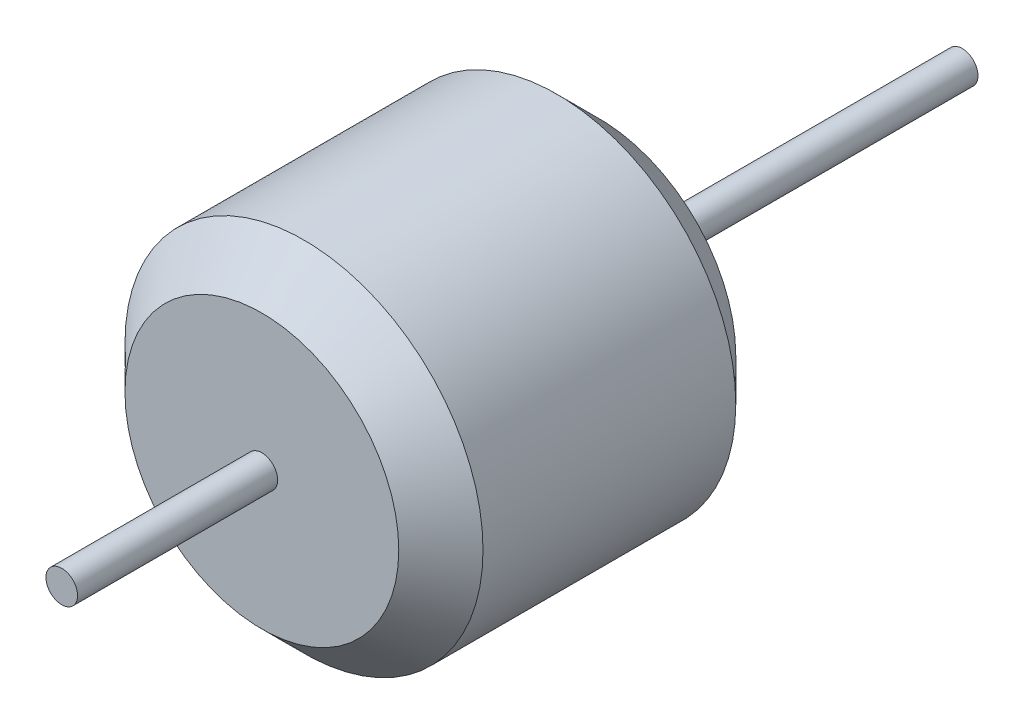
ISO-10303-21;
HEADER;
FILE_DESCRIPTION(('STEP AP214'),'2;1');
FILE_NAME('part.step','',(''),(''),'','','');
FILE_SCHEMA(('AUTOMOTIVE_DESIGN { 1 0 10303 214 1 1 1 1 }'));
ENDSEC;
DATA;
#1=APPLICATION_CONTEXT('core data for automotive mechanical design processes');
#2=APPLICATION_PROTOCOL_DEFINITION('international standard','automotive_design',2000,#1);
#3=PRODUCT_CONTEXT('',#1,'mechanical');
#4=PRODUCT('Part','Part','',(#3));
#5=PRODUCT_RELATED_PRODUCT_CATEGORY('part','',(#4));
#6=PRODUCT_DEFINITION_FORMATION('','',#4);
#7=PRODUCT_DEFINITION_CONTEXT('part definition',#1,'design');
#8=PRODUCT_DEFINITION('design','',#6,#7);
#9=PRODUCT_DEFINITION_SHAPE('','',#8);
#10=(LENGTH_UNIT() NAMED_UNIT(*) SI_UNIT(.MILLI.,.METRE.));
#11=(NAMED_UNIT(*) PLANE_ANGLE_UNIT() SI_UNIT($,.RADIAN.));
#12=(NAMED_UNIT(*) SI_UNIT($,.STERADIAN.) SOLID_ANGLE_UNIT());
#13=UNCERTAINTY_MEASURE_WITH_UNIT(LENGTH_MEASURE(1.E-05),#10,'distance_accuracy_value','');
#14=(GEOMETRIC_REPRESENTATION_CONTEXT(3) GLOBAL_UNCERTAINTY_ASSIGNED_CONTEXT((#13)) GLOBAL_UNIT_ASSIGNED_CONTEXT((#10,
#11,#12)) REPRESENTATION_CONTEXT('',''));
#15=CARTESIAN_POINT('',(0.,0.,0.));
#16=DIRECTION('',(0.,0.,1.));
#17=DIRECTION('',(1.,0.,0.));
#18=AXIS2_PLACEMENT_3D('',#15,#16,#17);
#19=CARTESIAN_POINT('',(0.,0.,32.));
#20=DIRECTION('',(0.,0.,-1.));
#21=DIRECTION('',(-1.,0.,0.));
#22=AXIS2_PLACEMENT_3D('',#19,#20,#21);
#23=CYLINDRICAL_SURFACE('',#22,17.);
#24=CARTESIAN_POINT('',(0.,0.,3.99999999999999));
#25=DIRECTION('',(0.,0.,1.));
#26=DIRECTION('',(1.,0.,0.));
#27=AXIS2_PLACEMENT_3D('',#24,#25,#26);
#28=CIRCLE('',#27,17.);
#29=CARTESIAN_POINT('',(17.,0.,3.99999999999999));
#30=VERTEX_POINT('',#29);
#31=EDGE_CURVE('E54',#30,#30,#28,.T.);
#32=ORIENTED_EDGE('',*,*,#31,.T.);
#33=EDGE_LOOP('',(#32));
#34=FACE_BOUND('',#33,.T.);
#35=CARTESIAN_POINT('',(0.,0.,28.));
#36=DIRECTION('',(0.,0.,1.));
#37=DIRECTION('',(1.,0.,0.));
#38=AXIS2_PLACEMENT_3D('',#35,#36,#37);
#39=CIRCLE('',#38,17.);
#40=CARTESIAN_POINT('',(17.,0.,28.));
#41=VERTEX_POINT('',#40);
#42=EDGE_CURVE('E51',#41,#41,#39,.F.);
#43=ORIENTED_EDGE('',*,*,#42,.T.);
#44=EDGE_LOOP('',(#43));
#45=FACE_BOUND('',#44,.T.);
#46=ADVANCED_FACE('F33',(#34,#45),#23,.T.);
#47=CARTESIAN_POINT('',(0.,0.,32.));
#48=DIRECTION('',(0.,0.,1.));
#49=DIRECTION('',(1.,0.,0.));
#50=AXIS2_PLACEMENT_3D('',#47,#48,#49);
#51=PLANE('',#50);
#52=CARTESIAN_POINT('',(0.,0.,32.));
#53=DIRECTION('',(0.,0.,1.));
#54=DIRECTION('',(1.,0.,0.));
#55=AXIS2_PLACEMENT_3D('',#52,#53,#54);
#56=CIRCLE('',#55,1.5);
#57=CARTESIAN_POINT('',(1.5,0.,32.));
#58=VERTEX_POINT('',#57);
#59=EDGE_CURVE('E10',#58,#58,#56,.T.);
#60=ORIENTED_EDGE('',*,*,#59,.F.);
#61=EDGE_LOOP('',(#60));
#62=FACE_BOUND('',#61,.T.);
#63=CARTESIAN_POINT('',(0.,0.,32.));
#64=DIRECTION('',(0.,0.,1.));
#65=DIRECTION('',(1.,0.,0.));
#66=AXIS2_PLACEMENT_3D('',#63,#64,#65);
#67=CIRCLE('',#66,13.);
#68=CARTESIAN_POINT('',(13.,0.,32.));
#69=VERTEX_POINT('',#68);
#70=EDGE_CURVE('E41',#69,#69,#67,.T.);
#71=ORIENTED_EDGE('',*,*,#70,.T.);
#72=EDGE_LOOP('',(#71));
#73=FACE_BOUND('',#72,.T.);
#74=ADVANCED_FACE('F69',(#62,#73),#51,.T.);
#75=CARTESIAN_POINT('',(0.,0.,0.));
#76=DIRECTION('',(0.,0.,1.));
#77=DIRECTION('',(1.,0.,0.));
#78=AXIS2_PLACEMENT_3D('',#75,#76,#77);
#79=PLANE('',#78);
#80=CARTESIAN_POINT('',(0.,0.,0.));
#81=DIRECTION('',(0.,0.,1.));
#82=DIRECTION('',(1.,0.,0.));
#83=AXIS2_PLACEMENT_3D('',#80,#81,#82);
#84=CIRCLE('',#83,1.5);
#85=CARTESIAN_POINT('',(1.5,0.,0.));
#86=VERTEX_POINT('',#85);
#87=EDGE_CURVE('E37',#86,#86,#84,.T.);
#88=ORIENTED_EDGE('',*,*,#87,.T.);
#89=EDGE_LOOP('',(#88));
#90=FACE_BOUND('',#89,.T.);
#91=CARTESIAN_POINT('',(0.,0.,0.));
#92=DIRECTION('',(0.,0.,1.));
#93=DIRECTION('',(1.,0.,0.));
#94=AXIS2_PLACEMENT_3D('',#91,#92,#93);
#95=CIRCLE('',#94,13.);
#96=CARTESIAN_POINT('',(13.,0.,0.));
#97=VERTEX_POINT('',#96);
#98=EDGE_CURVE('E46',#97,#97,#95,.F.);
#99=ORIENTED_EDGE('',*,*,#98,.T.);
#100=EDGE_LOOP('',(#99));
#101=FACE_BOUND('',#100,.T.);
#102=ADVANCED_FACE('F60',(#90,#101),#79,.F.);
#103=CARTESIAN_POINT('',(0.,0.,3.99999999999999));
#104=DIRECTION('',(0.,0.,1.));
#105=DIRECTION('',(1.,0.,0.));
#106=AXIS2_PLACEMENT_3D('',#103,#104,#105);
#107=CONICAL_SURFACE('',#106,17.,0.78539816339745);
#108=ORIENTED_EDGE('',*,*,#98,.F.);
#109=EDGE_LOOP('',(#108));
#110=FACE_BOUND('',#109,.T.);
#111=ORIENTED_EDGE('',*,*,#31,.F.);
#112=EDGE_LOOP('',(#111));
#113=FACE_BOUND('',#112,.T.);
#114=ADVANCED_FACE('F62',(#110,#113),#107,.T.);
#115=CARTESIAN_POINT('',(0.,0.,32.));
#116=DIRECTION('',(0.,0.,-1.));
#117=DIRECTION('',(-1.,0.,0.));
#118=AXIS2_PLACEMENT_3D('',#115,#116,#117);
#119=CONICAL_SURFACE('',#118,13.,0.785398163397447);
#120=ORIENTED_EDGE('',*,*,#42,.F.);
#121=EDGE_LOOP('',(#120));
#122=FACE_BOUND('',#121,.T.);
#123=ORIENTED_EDGE('',*,*,#70,.F.);
#124=EDGE_LOOP('',(#123));
#125=FACE_BOUND('',#124,.T.);
#126=ADVANCED_FACE('F35',(#122,#125),#119,.T.);
#127=CARTESIAN_POINT('',(0.,0.,-34.5));
#128=DIRECTION('',(0.,0.,1.));
#129=DIRECTION('',(1.,0.,0.));
#130=AXIS2_PLACEMENT_3D('',#127,#128,#129);
#131=PLANE('',#130);
#132=CARTESIAN_POINT('',(0.,0.,-34.5));
#133=DIRECTION('',(0.,0.,1.));
#134=DIRECTION('',(1.,0.,0.));
#135=AXIS2_PLACEMENT_3D('',#132,#133,#134);
#136=CIRCLE('',#135,1.5);
#137=CARTESIAN_POINT('',(1.5,0.,-34.5));
#138=VERTEX_POINT('',#137);
#139=EDGE_CURVE('E49',#138,#138,#136,.T.);
#140=ORIENTED_EDGE('',*,*,#139,.F.);
#141=EDGE_LOOP('',(#140));
#142=FACE_BOUND('',#141,.T.);
#143=ADVANCED_FACE('F75',(#142),#131,.F.);
#144=CARTESIAN_POINT('',(0.,0.,-34.5));
#145=DIRECTION('',(0.,0.,1.));
#146=DIRECTION('',(1.,0.,0.));
#147=AXIS2_PLACEMENT_3D('',#144,#145,#146);
#148=CYLINDRICAL_SURFACE('',#147,1.5);
#149=ORIENTED_EDGE('',*,*,#139,.T.);
#150=EDGE_LOOP('',(#149));
#151=FACE_BOUND('',#150,.T.);
#152=ORIENTED_EDGE('',*,*,#87,.F.);
#153=EDGE_LOOP('',(#152));
#154=FACE_BOUND('',#153,.T.);
#155=ADVANCED_FACE('F91',(#151,#154),#148,.T.);
#156=ORIENTED_EDGE('',*,*,#59,.T.);
#157=EDGE_LOOP('',(#156));
#158=FACE_BOUND('',#157,.T.);
#159=CARTESIAN_POINT('',(0.,0.,51.));
#160=DIRECTION('',(0.,0.,1.));
#161=DIRECTION('',(1.,0.,0.));
#162=AXIS2_PLACEMENT_3D('',#159,#160,#161);
#163=CIRCLE('',#162,1.5);
#164=CARTESIAN_POINT('',(1.5,0.,51.));
#165=VERTEX_POINT('',#164);
#166=EDGE_CURVE('E101',#165,#165,#163,.T.);
#167=ORIENTED_EDGE('',*,*,#166,.F.);
#168=EDGE_LOOP('',(#167));
#169=FACE_BOUND('',#168,.T.);
#170=ADVANCED_FACE('F87',(#158,#169),#148,.T.);
#171=CARTESIAN_POINT('',(0.,0.,51.));
#172=DIRECTION('',(0.,0.,1.));
#173=DIRECTION('',(1.,0.,0.));
#174=AXIS2_PLACEMENT_3D('',#171,#172,#173);
#175=PLANE('',#174);
#176=ORIENTED_EDGE('',*,*,#166,.T.);
#177=EDGE_LOOP('',(#176));
#178=FACE_BOUND('',#177,.T.);
#179=ADVANCED_FACE('F90',(#178),#175,.T.);
#180=CLOSED_SHELL('',(#46,#74,#102,#114,#126,#143,#155,#170,#179));
#181=MANIFOLD_SOLID_BREP('B2',#180);
#182=ADVANCED_BREP_SHAPE_REPRESENTATION('',(#18,#181),#14);
#183=SHAPE_DEFINITION_REPRESENTATION(#9,#182);
ENDSEC;
END-ISO-10303-21;
